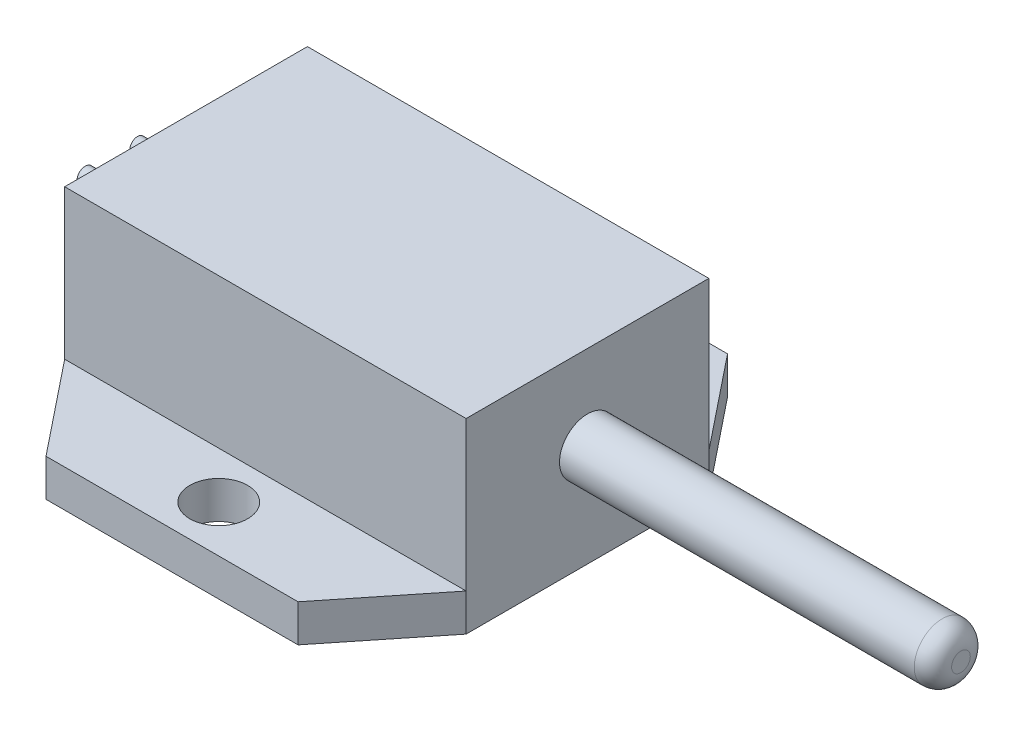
from build123d import *

# Parameters (mm, degrees)
SKETCH1_R           = 1.55
BOSS_EXTRUDE1_DEPTH = 2
SKETCH2_W           = 21.5
SKETCH2_H           = 13
BOSS_EXTRUDE2_DEPTH = 8
CUT_EXTRUDE1_DEPTH  = 1
SKETCH5_R           = 0.413581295
SKETCH5_R_2         = 0.437657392
BOSS_EXTRUDE3_DEPTH = 5
SKETCH6_R           = 1.5
BOSS_EXTRUDE4_DEPTH = 20
FILLET4_R           = 1


with BuildPart() as part:
    # Sketch1 → Boss-Extrude1 (new body)
    with BuildSketch(Plane(origin=(0, 0, 0), x_dir=(1, 0, 0), z_dir=(0, 1, 0))):
        Polygon((-10.75, 6.5), (-6.75, 11.5), (6.75, 11.5), (10.75, 6.5), (10.75, -6.5), (6.75, -11.5), (-6.75, -11.5), (-10.75, -6.5), align=None)
        with Locations(Location((0, -9, 0), (0, 0, 270))):
            Circle(SKETCH1_R, mode=Mode.SUBTRACT)
        with Locations(Location((0, 9, 0), (0, 0, 270))):
            Circle(SKETCH1_R, mode=Mode.SUBTRACT)
    extrude(amount=BOSS_EXTRUDE1_DEPTH)

    # Sketch2 → Boss-Extrude2 (add)
    with BuildSketch(Plane(origin=(0, 2, 0), x_dir=(1, 0, 0), z_dir=(0, 1, 0))):
        Rectangle(SKETCH2_W, SKETCH2_H)
    extrude(amount=BOSS_EXTRUDE2_DEPTH)

    # Sketch4 → Cut-Extrude1 (cut)
    with BuildSketch(Plane.ZY.offset(10.75)):
        with BuildLine():
            Line((-1.5, 6.958739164), (1.5, 6.958739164))
            ThreePointArc((1.5, 6.958739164), (2.5, 5.958739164), (1.5, 4.958739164))
            Line((1.5, 4.958739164), (-1.5, 4.958739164))
            ThreePointArc((-1.5, 4.958739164), (-2.5, 5.958739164), (-1.5, 6.958739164))
        make_face()
    extrude(amount=-CUT_EXTRUDE1_DEPTH, mode=Mode.SUBTRACT)

    # Sketch5 → Boss-Extrude3 (add)
    with BuildSketch(Plane.ZY.offset(9.75)):
        with Locations((-1.4, 5.967331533)):
            Circle(SKETCH5_R)
        with Locations((1.4, 5.967331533)):
            Circle(SKETCH5_R_2)
    extrude(amount=BOSS_EXTRUDE3_DEPTH)

    # Sketch6 → Boss-Extrude4 (add)
    with BuildSketch(Plane(origin=(10.75, 0, 0), x_dir=(0, 0, -1), z_dir=(1, 0, 0))):
        with Locations((0, 5.464909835)):
            Circle(SKETCH6_R)
    extrude(amount=BOSS_EXTRUDE4_DEPTH)

    # Fillet4
    fillet4_edges = [part.edges().sort_by_distance(p)[0] for p in [
        (30.75, 5.464909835, 1.5),
    ]]
    fillet(fillet4_edges, radius=FILLET4_R)


solid = part.part
